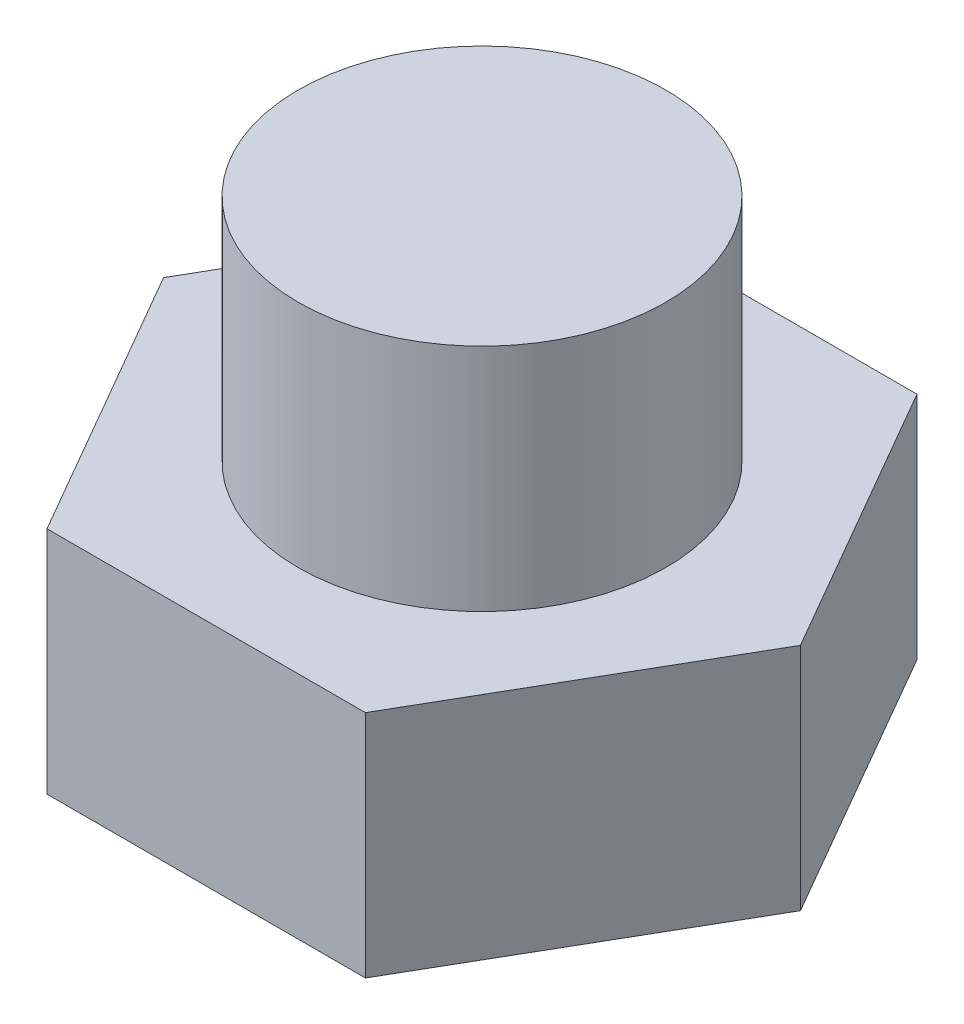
from build123d import *

# Parameters (mm, degrees)
BOSS_EXTRUDE2_DEPTH = 10
SKETCH3_R           = 8
BOSS_EXTRUDE3_DEPTH = 10


with BuildPart() as part:
    # Sketch1 → Boss-Extrude2 (new body)
    with BuildSketch(Plane(origin=(0, 0, 0), x_dir=(1, 0, 0), z_dir=(0, 1, 0))):
        Polygon((6.92820323, 12), (-6.92820323, 12), (-13.856406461, 0), (-6.92820323, -12), (6.92820323, -12), (13.856406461, 0), align=None)
    extrude(amount=BOSS_EXTRUDE2_DEPTH)

    # Sketch3 → Boss-Extrude3 (add)
    with BuildSketch(Plane(origin=(0, 10, 0), x_dir=(1, 0, 0), z_dir=(0, 1, 0))):
        with Locations(Location((0, 0, 0), (0, 0, 270))):
            Circle(SKETCH3_R)
    extrude(amount=BOSS_EXTRUDE3_DEPTH)


solid = part.part
